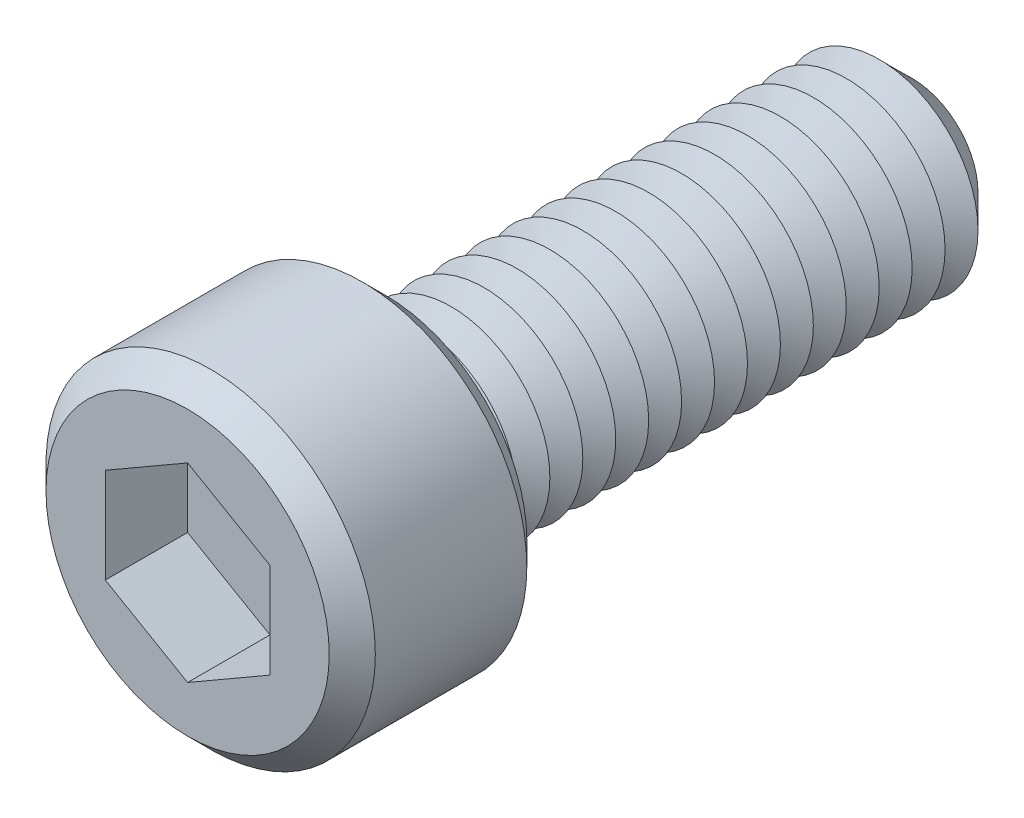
from build123d import *

# Parameters (mm, degrees)
SKETCH1_R           = 5
BOSS_EXTRUDE1_DEPTH = 6
SKETCH2_R           = 3
BOSS_EXTRUDE2_DEPTH = 16
CHAMFER1_SIZE       = 1
LPATTERN1_COUNT     = 15
LPATTERN1_PITCH     = 1
CUT_EXTRUDE1_DEPTH  = 2.5
SKETCH6_R           = 0.8
CUT_EXTRUDE2_DEPTH  = 19.5
CHAMFER2_SIZE       = 0.7


with BuildPart() as part:
    # Sketch1 → Boss-Extrude1 (new body)
    with BuildSketch(Plane.XY):
        Circle(SKETCH1_R)
    extrude(amount=BOSS_EXTRUDE1_DEPTH)

    # Sketch2 → Boss-Extrude2 (add)
    with BuildSketch(Plane(origin=(0, 0, 0), x_dir=(-1, 0, 0), z_dir=(0, 0, -1))):
        Circle(SKETCH2_R)
    extrude(amount=BOSS_EXTRUDE2_DEPTH)

    # Chamfer1
    chamfer1_edges = [part.edges().sort_by_distance(p)[0] for p in [
        (3, 0, -16),
    ]]
    chamfer(chamfer1_edges, length=CHAMFER1_SIZE)

    # Sketch4 → Cut-Revolve1 (revolve, cut)
    with BuildSketch(Plane(origin=(0, 0, 0), x_dir=(0, 0, -1), z_dir=(1, 0, 0)), mode=Mode.PRIVATE) as cut_revolve1_sk:
        Polygon((0, 3), (0.5, 2.133974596), (1, 3), align=None)
    cut_revolve1 = revolve(cut_revolve1_sk.sketch.rotate(Axis((0, 0, 2.512122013), (0, 0, -1)), 90), axis=Axis((0, 0, 2.512122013), (0, 0, -1)), mode=Mode.SUBTRACT)

    # LPattern1: Cut-Revolve1 ×15
    with Locations(*[(0, 0, -i * LPATTERN1_PITCH) for i in range(1, LPATTERN1_COUNT)]):
        add(cut_revolve1, mode=Mode.SUBTRACT)

    # Sketch5 → Cut-Extrude1 (cut)
    with BuildSketch(Plane.XY.offset(6)):
        Polygon((0, 2.886751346), (-2.5, 1.443375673), (-2.5, -1.443375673), (0, -2.886751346), (2.5, -1.443375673), (2.5, 1.443375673), align=None)
    extrude(amount=-CUT_EXTRUDE1_DEPTH, mode=Mode.SUBTRACT)

    # Sketch6 → Cut-Extrude2 (cut)
    with BuildSketch(Plane.XY.offset(3.5)):
        Circle(SKETCH6_R)
    extrude(amount=-CUT_EXTRUDE2_DEPTH, mode=Mode.SUBTRACT)

    # Chamfer2
    chamfer2_edges = [part.edges().sort_by_distance(p)[0] for p in [
        (-5, 0, 0),
        (-5, 0, 6),
    ]]
    chamfer(chamfer2_edges, length=CHAMFER2_SIZE)


solid = part.part
